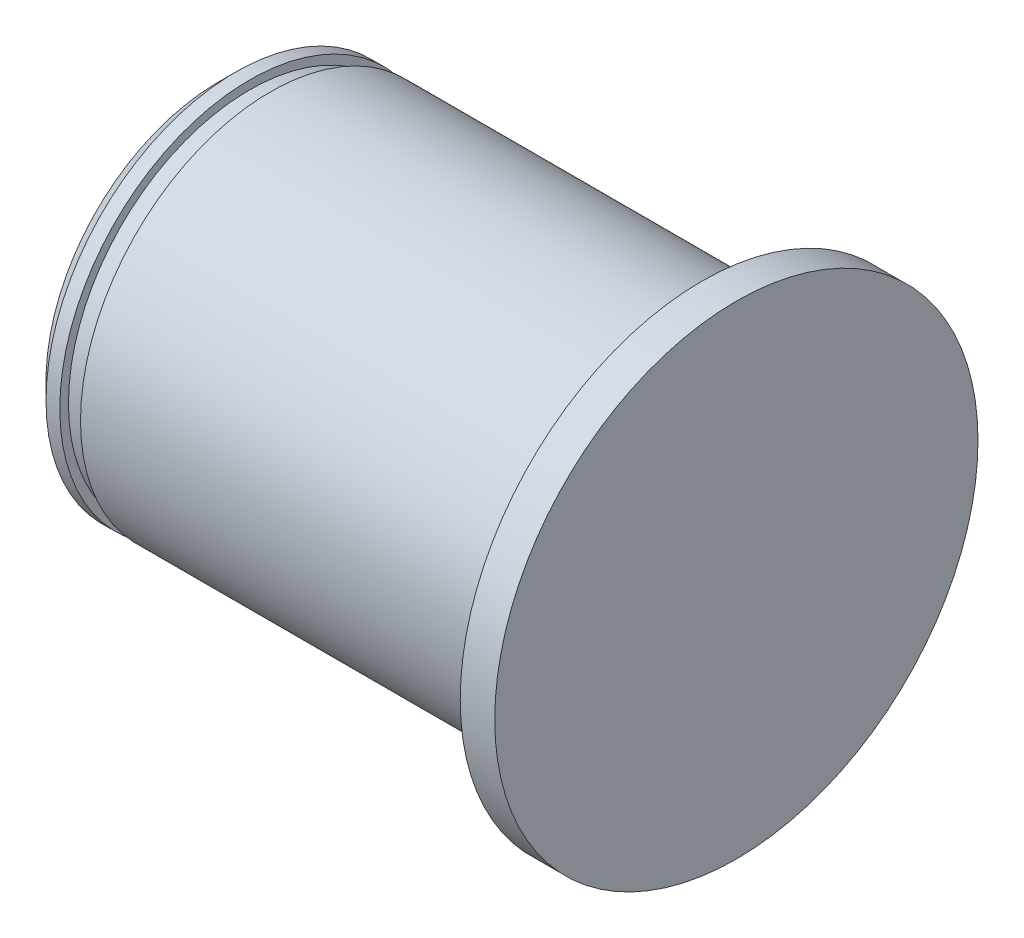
from build123d import *

# Parameters (mm, degrees)
CHANFREIN1_SIZE = 1


with BuildPart() as part:
    # Esquisse1 → R_volution1 (revolve)
    with BuildSketch(Plane.XY, mode=Mode.PRIVATE) as r_volution1_sk:
        Polygon((0, 0), (0, 14), (-2, 14), (-2, 11), (-27, 11), (-27, 10.5), (-28.2, 10.5), (-28.2, 11), (-30, 11), (-30, 0), align=None)
    revolve(r_volution1_sk.sketch.rotate(Axis((-30, 0, 0), (1, 0, 0)), 90), axis=Axis((-30, 0, 0), (1, 0, 0)))

    # Chanfrein1
    chanfrein1_edges = [part.edges().sort_by_distance(p)[0] for p in [
        (-30, 0, -11),
    ]]
    chamfer(chanfrein1_edges, length=CHANFREIN1_SIZE)


solid = part.part
